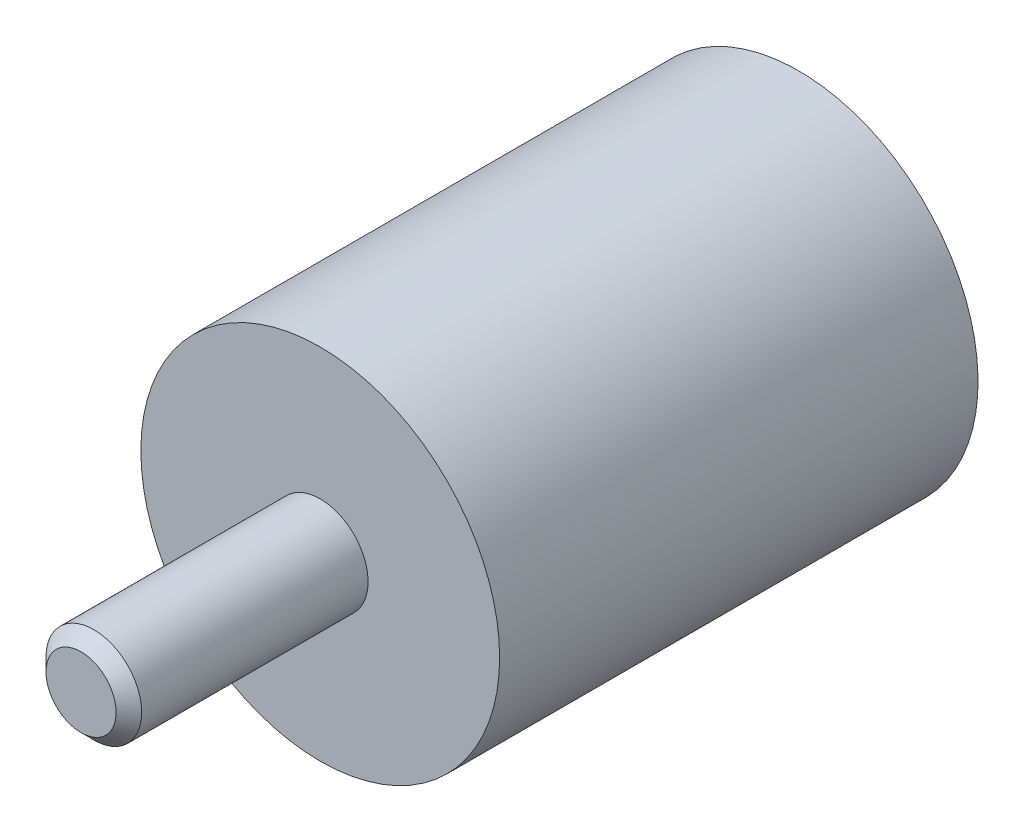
ISO-10303-21;
HEADER;
FILE_DESCRIPTION(('STEP AP214'),'2;1');
FILE_NAME('part.step','',(''),(''),'','','');
FILE_SCHEMA(('AUTOMOTIVE_DESIGN { 1 0 10303 214 1 1 1 1 }'));
ENDSEC;
DATA;
#1=APPLICATION_CONTEXT('core data for automotive mechanical design processes');
#2=APPLICATION_PROTOCOL_DEFINITION('international standard','automotive_design',2000,#1);
#3=PRODUCT_CONTEXT('',#1,'mechanical');
#4=PRODUCT('Part','Part','',(#3));
#5=PRODUCT_RELATED_PRODUCT_CATEGORY('part','',(#4));
#6=PRODUCT_DEFINITION_FORMATION('','',#4);
#7=PRODUCT_DEFINITION_CONTEXT('part definition',#1,'design');
#8=PRODUCT_DEFINITION('design','',#6,#7);
#9=PRODUCT_DEFINITION_SHAPE('','',#8);
#10=(LENGTH_UNIT() NAMED_UNIT(*) SI_UNIT(.MILLI.,.METRE.));
#11=(NAMED_UNIT(*) PLANE_ANGLE_UNIT() SI_UNIT($,.RADIAN.));
#12=(NAMED_UNIT(*) SI_UNIT($,.STERADIAN.) SOLID_ANGLE_UNIT());
#13=UNCERTAINTY_MEASURE_WITH_UNIT(LENGTH_MEASURE(1.E-05),#10,'distance_accuracy_value','');
#14=(GEOMETRIC_REPRESENTATION_CONTEXT(3) GLOBAL_UNCERTAINTY_ASSIGNED_CONTEXT((#13)) GLOBAL_UNIT_ASSIGNED_CONTEXT((#10,
#11,#12)) REPRESENTATION_CONTEXT('',''));
#15=CARTESIAN_POINT('',(0.,0.,0.));
#16=DIRECTION('',(0.,0.,1.));
#17=DIRECTION('',(1.,0.,0.));
#18=AXIS2_PLACEMENT_3D('',#15,#16,#17);
#19=CARTESIAN_POINT('',(0.,0.,0.33333333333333));
#20=DIRECTION('',(0.,0.,1.));
#21=DIRECTION('',(0.,-1.,0.));
#22=AXIS2_PLACEMENT_3D('',#19,#20,#21);
#23=CYLINDRICAL_SURFACE('',#22,7.5);
#24=CARTESIAN_POINT('',(0.,0.,0.));
#25=DIRECTION('',(0.,0.,1.));
#26=DIRECTION('',(0.,-1.,0.));
#27=AXIS2_PLACEMENT_3D('',#24,#25,#26);
#28=CIRCLE('',#27,7.5);
#29=CARTESIAN_POINT('',(0.,-7.5,0.));
#30=VERTEX_POINT('',#29);
#31=EDGE_CURVE('E23',#30,#30,#28,.T.);
#32=ORIENTED_EDGE('',*,*,#31,.T.);
#33=EDGE_LOOP('',(#32));
#34=FACE_BOUND('',#33,.T.);
#35=CARTESIAN_POINT('',(0.,0.,20.));
#36=DIRECTION('',(0.,0.,-1.));
#37=DIRECTION('',(-1.,0.,0.));
#38=AXIS2_PLACEMENT_3D('',#35,#36,#37);
#39=CIRCLE('',#38,7.5);
#40=CARTESIAN_POINT('',(-7.5,0.,20.));
#41=VERTEX_POINT('',#40);
#42=EDGE_CURVE('E32',#41,#41,#39,.T.);
#43=ORIENTED_EDGE('',*,*,#42,.T.);
#44=EDGE_LOOP('',(#43));
#45=FACE_BOUND('',#44,.T.);
#46=ADVANCED_FACE('F12',(#34,#45),#23,.T.);
#47=CARTESIAN_POINT('',(7.5,0.,0.));
#48=DIRECTION('',(0.,0.,-1.));
#49=DIRECTION('',(0.,1.,0.));
#50=AXIS2_PLACEMENT_3D('',#47,#48,#49);
#51=PLANE('',#50);
#52=CARTESIAN_POINT('',(0.,0.,0.));
#53=DIRECTION('',(0.,0.,-1.));
#54=DIRECTION('',(0.,1.,0.));
#55=AXIS2_PLACEMENT_3D('',#52,#53,#54);
#56=CIRCLE('',#55,2.4);
#57=CARTESIAN_POINT('',(0.,2.4,0.));
#58=VERTEX_POINT('',#57);
#59=EDGE_CURVE('E8',#58,#58,#56,.F.);
#60=ORIENTED_EDGE('',*,*,#59,.T.);
#61=EDGE_LOOP('',(#60));
#62=FACE_BOUND('',#61,.T.);
#63=ORIENTED_EDGE('',*,*,#31,.F.);
#64=EDGE_LOOP('',(#63));
#65=FACE_BOUND('',#64,.T.);
#66=ADVANCED_FACE('F58',(#62,#65),#51,.T.);
#67=CARTESIAN_POINT('',(0.,0.,0.));
#68=DIRECTION('',(0.,0.,1.));
#69=DIRECTION('',(0.,-1.,0.));
#70=AXIS2_PLACEMENT_3D('',#67,#68,#69);
#71=CYLINDRICAL_SURFACE('',#70,2.);
#72=CARTESIAN_POINT('',(0.,0.,0.399999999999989));
#73=DIRECTION('',(0.,0.,-1.));
#74=DIRECTION('',(0.,1.,0.));
#75=AXIS2_PLACEMENT_3D('',#72,#73,#74);
#76=CIRCLE('',#75,2.);
#77=CARTESIAN_POINT('',(0.,2.,0.399999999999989));
#78=VERTEX_POINT('',#77);
#79=EDGE_CURVE('E19',#78,#78,#76,.T.);
#80=ORIENTED_EDGE('',*,*,#79,.T.);
#81=EDGE_LOOP('',(#80));
#82=FACE_BOUND('',#81,.T.);
#83=CARTESIAN_POINT('',(0.,0.,4.));
#84=DIRECTION('',(0.,0.,-1.));
#85=DIRECTION('',(0.,1.,0.));
#86=AXIS2_PLACEMENT_3D('',#83,#84,#85);
#87=CIRCLE('',#86,2.);
#88=CARTESIAN_POINT('',(0.,2.,4.));
#89=VERTEX_POINT('',#88);
#90=EDGE_CURVE('E27',#89,#89,#87,.T.);
#91=ORIENTED_EDGE('',*,*,#90,.F.);
#92=EDGE_LOOP('',(#91));
#93=FACE_BOUND('',#92,.T.);
#94=ADVANCED_FACE('F63',(#82,#93),#71,.F.);
#95=CARTESIAN_POINT('',(0.,0.,4.));
#96=DIRECTION('',(0.,0.,-1.));
#97=DIRECTION('',(0.,1.,0.));
#98=AXIS2_PLACEMENT_3D('',#95,#96,#97);
#99=PLANE('',#98);
#100=ORIENTED_EDGE('',*,*,#90,.T.);
#101=EDGE_LOOP('',(#100));
#102=FACE_BOUND('',#101,.T.);
#103=ADVANCED_FACE('F69',(#102),#99,.T.);
#104=CARTESIAN_POINT('',(0.,0.,0.399999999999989));
#105=DIRECTION('',(0.,0.,-1.));
#106=DIRECTION('',(0.,1.,0.));
#107=AXIS2_PLACEMENT_3D('',#104,#105,#106);
#108=CONICAL_SURFACE('',#107,2.,0.785398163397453);
#109=ORIENTED_EDGE('',*,*,#59,.F.);
#110=EDGE_LOOP('',(#109));
#111=FACE_BOUND('',#110,.T.);
#112=ORIENTED_EDGE('',*,*,#79,.F.);
#113=EDGE_LOOP('',(#112));
#114=FACE_BOUND('',#113,.T.);
#115=ADVANCED_FACE('F14',(#111,#114),#108,.F.);
#116=CARTESIAN_POINT('',(0.,7.5,20.));
#117=DIRECTION('',(0.,0.,1.));
#118=DIRECTION('',(1.,0.,0.));
#119=AXIS2_PLACEMENT_3D('',#116,#117,#118);
#120=PLANE('',#119);
#121=CARTESIAN_POINT('',(0.,0.,20.));
#122=DIRECTION('',(0.,0.,-1.));
#123=DIRECTION('',(-1.,0.,0.));
#124=AXIS2_PLACEMENT_3D('',#121,#122,#123);
#125=CIRCLE('',#124,2.);
#126=CARTESIAN_POINT('',(-2.,0.,20.));
#127=VERTEX_POINT('',#126);
#128=EDGE_CURVE('E35',#127,#127,#125,.T.);
#129=ORIENTED_EDGE('',*,*,#128,.T.);
#130=EDGE_LOOP('',(#129));
#131=FACE_BOUND('',#130,.T.);
#132=ORIENTED_EDGE('',*,*,#42,.F.);
#133=EDGE_LOOP('',(#132));
#134=FACE_BOUND('',#133,.T.);
#135=ADVANCED_FACE('F73',(#131,#134),#120,.T.);
#136=CARTESIAN_POINT('',(0.,0.,0.));
#137=DIRECTION('',(0.,0.,-1.));
#138=DIRECTION('',(-1.,0.,0.));
#139=AXIS2_PLACEMENT_3D('',#136,#137,#138);
#140=CYLINDRICAL_SURFACE('',#139,2.);
#141=CARTESIAN_POINT('',(0.,0.,29.4654758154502));
#142=DIRECTION('',(0.,0.,-1.));
#143=DIRECTION('',(-1.,0.,0.));
#144=AXIS2_PLACEMENT_3D('',#141,#142,#143);
#145=CIRCLE('',#144,2.);
#146=CARTESIAN_POINT('',(-2.,0.,29.4654758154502));
#147=VERTEX_POINT('',#146);
#148=EDGE_CURVE('E38',#147,#147,#145,.T.);
#149=ORIENTED_EDGE('',*,*,#148,.T.);
#150=EDGE_LOOP('',(#149));
#151=FACE_BOUND('',#150,.T.);
#152=ORIENTED_EDGE('',*,*,#128,.F.);
#153=EDGE_LOOP('',(#152));
#154=FACE_BOUND('',#153,.T.);
#155=ADVANCED_FACE('F55',(#151,#154),#140,.T.);
#156=CARTESIAN_POINT('',(0.,0.,29.4654758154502));
#157=DIRECTION('',(0.,0.,-1.));
#158=DIRECTION('',(-1.,0.,0.));
#159=AXIS2_PLACEMENT_3D('',#156,#157,#158);
#160=CONICAL_SURFACE('',#159,2.,0.785398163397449);
#161=CARTESIAN_POINT('',(0.,0.,30.));
#162=DIRECTION('',(0.,0.,-1.));
#163=DIRECTION('',(-1.,0.,0.));
#164=AXIS2_PLACEMENT_3D('',#161,#162,#163);
#165=CIRCLE('',#164,1.4654758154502);
#166=CARTESIAN_POINT('',(-1.4654758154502,0.,30.));
#167=VERTEX_POINT('',#166);
#168=EDGE_CURVE('E41',#167,#167,#165,.T.);
#169=ORIENTED_EDGE('',*,*,#168,.T.);
#170=EDGE_LOOP('',(#169));
#171=FACE_BOUND('',#170,.T.);
#172=ORIENTED_EDGE('',*,*,#148,.F.);
#173=EDGE_LOOP('',(#172));
#174=FACE_BOUND('',#173,.T.);
#175=ADVANCED_FACE('F45',(#171,#174),#160,.T.);
#176=CARTESIAN_POINT('',(0.,1.4654758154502,30.));
#177=DIRECTION('',(0.,0.,1.));
#178=DIRECTION('',(1.,0.,0.));
#179=AXIS2_PLACEMENT_3D('',#176,#177,#178);
#180=PLANE('',#179);
#181=ORIENTED_EDGE('',*,*,#168,.F.);
#182=EDGE_LOOP('',(#181));
#183=FACE_BOUND('',#182,.T.);
#184=ADVANCED_FACE('F48',(#183),#180,.T.);
#185=CLOSED_SHELL('',(#46,#66,#94,#103,#115,#135,#155,#175,#184));
#186=MANIFOLD_SOLID_BREP('B1',#185);
#187=ADVANCED_BREP_SHAPE_REPRESENTATION('',(#18,#186),#14);
#188=SHAPE_DEFINITION_REPRESENTATION(#9,#187);
ENDSEC;
END-ISO-10303-21;
